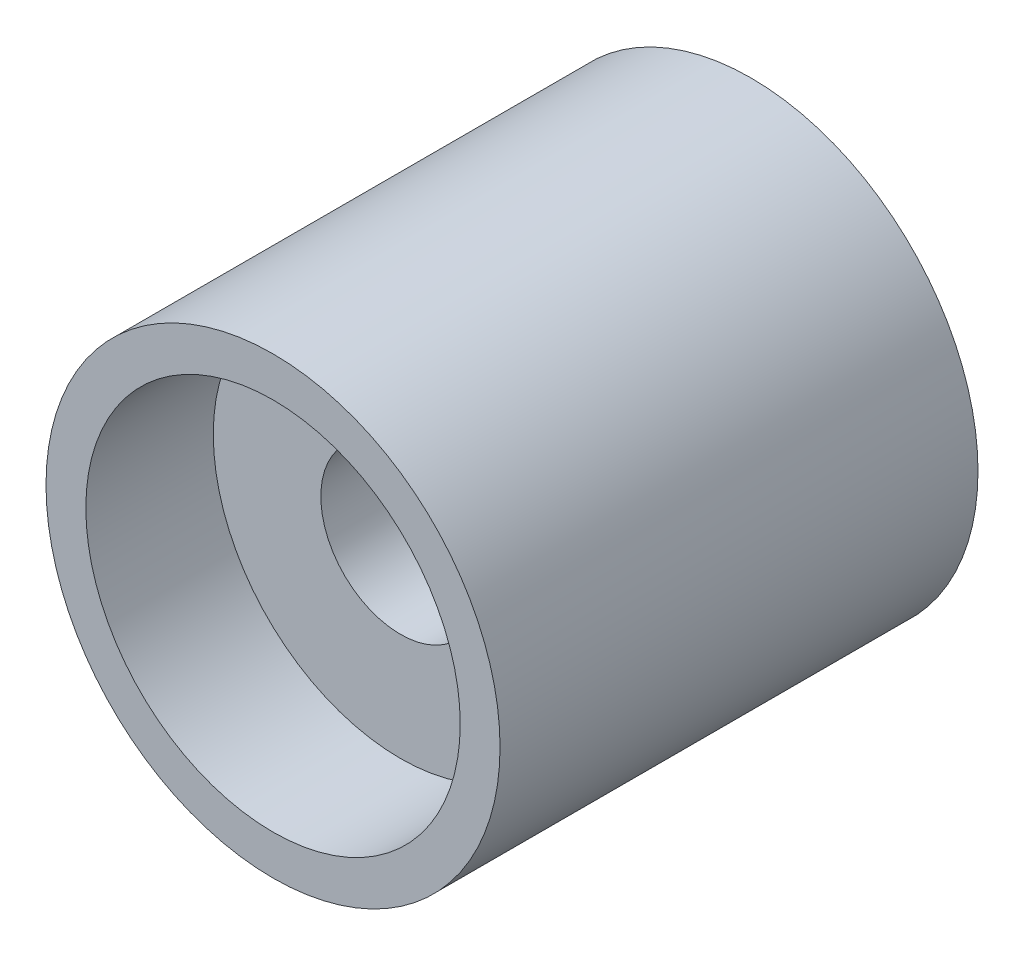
ISO-10303-21;
HEADER;
FILE_DESCRIPTION(('STEP AP214'),'2;1');
FILE_NAME('part.step','',(''),(''),'','','');
FILE_SCHEMA(('AUTOMOTIVE_DESIGN { 1 0 10303 214 1 1 1 1 }'));
ENDSEC;
DATA;
#1=APPLICATION_CONTEXT('core data for automotive mechanical design processes');
#2=APPLICATION_PROTOCOL_DEFINITION('international standard','automotive_design',2000,#1);
#3=PRODUCT_CONTEXT('',#1,'mechanical');
#4=PRODUCT('Part','Part','',(#3));
#5=PRODUCT_RELATED_PRODUCT_CATEGORY('part','',(#4));
#6=PRODUCT_DEFINITION_FORMATION('','',#4);
#7=PRODUCT_DEFINITION_CONTEXT('part definition',#1,'design');
#8=PRODUCT_DEFINITION('design','',#6,#7);
#9=PRODUCT_DEFINITION_SHAPE('','',#8);
#10=(LENGTH_UNIT() NAMED_UNIT(*) SI_UNIT(.MILLI.,.METRE.));
#11=(NAMED_UNIT(*) PLANE_ANGLE_UNIT() SI_UNIT($,.RADIAN.));
#12=(NAMED_UNIT(*) SI_UNIT($,.STERADIAN.) SOLID_ANGLE_UNIT());
#13=UNCERTAINTY_MEASURE_WITH_UNIT(LENGTH_MEASURE(1.E-05),#10,'distance_accuracy_value','');
#14=(GEOMETRIC_REPRESENTATION_CONTEXT(3) GLOBAL_UNCERTAINTY_ASSIGNED_CONTEXT((#13)) GLOBAL_UNIT_ASSIGNED_CONTEXT((#10,
#11,#12)) REPRESENTATION_CONTEXT('',''));
#15=CARTESIAN_POINT('',(0.,0.,0.));
#16=DIRECTION('',(0.,0.,1.));
#17=DIRECTION('',(1.,0.,0.));
#18=AXIS2_PLACEMENT_3D('',#15,#16,#17);
#19=CARTESIAN_POINT('',(0.,-34.5,-30.));
#20=DIRECTION('',(0.,0.,-1.));
#21=DIRECTION('',(1.,0.,0.));
#22=AXIS2_PLACEMENT_3D('',#19,#20,#21);
#23=PLANE('',#22);
#24=CARTESIAN_POINT('',(0.,0.,-30.));
#25=DIRECTION('',(0.,0.,-1.));
#26=DIRECTION('',(-1.,0.,0.));
#27=AXIS2_PLACEMENT_3D('',#24,#25,#26);
#28=CIRCLE('',#27,20.);
#29=CARTESIAN_POINT('',(-20.,0.,-30.));
#30=VERTEX_POINT('',#29);
#31=EDGE_CURVE('E35',#30,#30,#28,.T.);
#32=ORIENTED_EDGE('',*,*,#31,.F.);
#33=EDGE_LOOP('',(#32));
#34=FACE_BOUND('',#33,.T.);
#35=CARTESIAN_POINT('',(0.,0.,-30.));
#36=DIRECTION('',(0.,0.,1.));
#37=DIRECTION('',(1.,0.,0.));
#38=AXIS2_PLACEMENT_3D('',#35,#36,#37);
#39=CIRCLE('',#38,28.5);
#40=CARTESIAN_POINT('',(28.5,0.,-30.));
#41=VERTEX_POINT('',#40);
#42=EDGE_CURVE('E38',#41,#41,#39,.T.);
#43=ORIENTED_EDGE('',*,*,#42,.F.);
#44=EDGE_LOOP('',(#43));
#45=FACE_BOUND('',#44,.T.);
#46=ADVANCED_FACE('F12',(#34,#45),#23,.T.);
#47=CARTESIAN_POINT('',(0.,-34.5,30.));
#48=DIRECTION('',(0.,0.,1.));
#49=DIRECTION('',(-1.,0.,0.));
#50=AXIS2_PLACEMENT_3D('',#47,#48,#49);
#51=PLANE('',#50);
#52=CARTESIAN_POINT('',(0.,0.,30.));
#53=DIRECTION('',(0.,0.,-1.));
#54=DIRECTION('',(-1.,0.,0.));
#55=AXIS2_PLACEMENT_3D('',#52,#53,#54);
#56=CIRCLE('',#55,23.5);
#57=CARTESIAN_POINT('',(-23.5,0.,30.));
#58=VERTEX_POINT('',#57);
#59=EDGE_CURVE('E32',#58,#58,#56,.T.);
#60=ORIENTED_EDGE('',*,*,#59,.T.);
#61=EDGE_LOOP('',(#60));
#62=FACE_BOUND('',#61,.T.);
#63=CARTESIAN_POINT('',(0.,0.,30.));
#64=DIRECTION('',(0.,0.,1.));
#65=DIRECTION('',(1.,0.,0.));
#66=AXIS2_PLACEMENT_3D('',#63,#64,#65);
#67=CIRCLE('',#66,28.5);
#68=CARTESIAN_POINT('',(28.5,0.,30.));
#69=VERTEX_POINT('',#68);
#70=EDGE_CURVE('E39',#69,#69,#67,.T.);
#71=ORIENTED_EDGE('',*,*,#70,.T.);
#72=EDGE_LOOP('',(#71));
#73=FACE_BOUND('',#72,.T.);
#74=ADVANCED_FACE('F49',(#62,#73),#51,.T.);
#75=CARTESIAN_POINT('',(0.,-21.698214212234,14.));
#76=DIRECTION('',(0.,0.,1.));
#77=DIRECTION('',(-1.,0.,0.));
#78=AXIS2_PLACEMENT_3D('',#75,#76,#77);
#79=PLANE('',#78);
#80=CARTESIAN_POINT('',(0.,0.,14.));
#81=DIRECTION('',(0.,0.,-1.));
#82=DIRECTION('',(1.,0.,0.));
#83=AXIS2_PLACEMENT_3D('',#80,#81,#82);
#84=CIRCLE('',#83,10.);
#85=CARTESIAN_POINT('',(10.,0.,14.));
#86=VERTEX_POINT('',#85);
#87=EDGE_CURVE('E8',#86,#86,#84,.T.);
#88=ORIENTED_EDGE('',*,*,#87,.T.);
#89=EDGE_LOOP('',(#88));
#90=FACE_BOUND('',#89,.T.);
#91=CARTESIAN_POINT('',(0.,0.,14.));
#92=DIRECTION('',(0.,0.,-1.));
#93=DIRECTION('',(-1.,0.,0.));
#94=AXIS2_PLACEMENT_3D('',#91,#92,#93);
#95=CIRCLE('',#94,23.5);
#96=CARTESIAN_POINT('',(-23.5,0.,14.));
#97=VERTEX_POINT('',#96);
#98=EDGE_CURVE('E27',#97,#97,#95,.T.);
#99=ORIENTED_EDGE('',*,*,#98,.F.);
#100=EDGE_LOOP('',(#99));
#101=FACE_BOUND('',#100,.T.);
#102=ADVANCED_FACE('F14',(#90,#101),#79,.T.);
#103=CARTESIAN_POINT('',(0.,0.,-35.7089503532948));
#104=DIRECTION('',(0.,0.,-1.));
#105=DIRECTION('',(1.,0.,0.));
#106=AXIS2_PLACEMENT_3D('',#103,#104,#105);
#107=CYLINDRICAL_SURFACE('',#106,10.);
#108=CARTESIAN_POINT('',(0.,0.,-14.));
#109=DIRECTION('',(0.,0.,-1.));
#110=DIRECTION('',(1.,0.,0.));
#111=AXIS2_PLACEMENT_3D('',#108,#109,#110);
#112=CIRCLE('',#111,10.);
#113=CARTESIAN_POINT('',(10.,0.,-14.));
#114=VERTEX_POINT('',#113);
#115=EDGE_CURVE('E19',#114,#114,#112,.T.);
#116=ORIENTED_EDGE('',*,*,#115,.T.);
#117=EDGE_LOOP('',(#116));
#118=FACE_BOUND('',#117,.T.);
#119=ORIENTED_EDGE('',*,*,#87,.F.);
#120=EDGE_LOOP('',(#119));
#121=FACE_BOUND('',#120,.T.);
#122=ADVANCED_FACE('F69',(#118,#121),#107,.F.);
#123=CARTESIAN_POINT('',(0.,-20.,-14.));
#124=DIRECTION('',(0.,0.,-1.));
#125=DIRECTION('',(1.,0.,0.));
#126=AXIS2_PLACEMENT_3D('',#123,#124,#125);
#127=PLANE('',#126);
#128=CARTESIAN_POINT('',(0.,0.,-14.));
#129=DIRECTION('',(0.,0.,-1.));
#130=DIRECTION('',(1.,0.,0.));
#131=AXIS2_PLACEMENT_3D('',#128,#129,#130);
#132=CIRCLE('',#131,20.);
#133=CARTESIAN_POINT('',(20.,0.,-14.));
#134=VERTEX_POINT('',#133);
#135=EDGE_CURVE('E23',#134,#134,#132,.T.);
#136=ORIENTED_EDGE('',*,*,#135,.T.);
#137=EDGE_LOOP('',(#136));
#138=FACE_BOUND('',#137,.T.);
#139=ORIENTED_EDGE('',*,*,#115,.F.);
#140=EDGE_LOOP('',(#139));
#141=FACE_BOUND('',#140,.T.);
#142=ADVANCED_FACE('F66',(#138,#141),#127,.T.);
#143=CARTESIAN_POINT('',(0.,0.,-35.7089503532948));
#144=DIRECTION('',(0.,0.,-1.));
#145=DIRECTION('',(1.,0.,0.));
#146=AXIS2_PLACEMENT_3D('',#143,#144,#145);
#147=CYLINDRICAL_SURFACE('',#146,20.);
#148=ORIENTED_EDGE('',*,*,#135,.F.);
#149=EDGE_LOOP('',(#148));
#150=FACE_BOUND('',#149,.T.);
#151=ORIENTED_EDGE('',*,*,#31,.T.);
#152=EDGE_LOOP('',(#151));
#153=FACE_BOUND('',#152,.T.);
#154=ADVANCED_FACE('F62',(#150,#153),#147,.F.);
#155=CARTESIAN_POINT('',(0.,0.,-35.7089503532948));
#156=DIRECTION('',(0.,0.,-1.));
#157=DIRECTION('',(1.,0.,0.));
#158=AXIS2_PLACEMENT_3D('',#155,#156,#157);
#159=CYLINDRICAL_SURFACE('',#158,23.5);
#160=ORIENTED_EDGE('',*,*,#98,.T.);
#161=EDGE_LOOP('',(#160));
#162=FACE_BOUND('',#161,.T.);
#163=ORIENTED_EDGE('',*,*,#59,.F.);
#164=EDGE_LOOP('',(#163));
#165=FACE_BOUND('',#164,.T.);
#166=ADVANCED_FACE('F65',(#162,#165),#159,.F.);
#167=CARTESIAN_POINT('',(0.,0.,-30.));
#168=DIRECTION('',(0.,0.,1.));
#169=DIRECTION('',(1.,0.,0.));
#170=AXIS2_PLACEMENT_3D('',#167,#168,#169);
#171=CYLINDRICAL_SURFACE('',#170,28.5);
#172=ORIENTED_EDGE('',*,*,#42,.T.);
#173=EDGE_LOOP('',(#172));
#174=FACE_BOUND('',#173,.T.);
#175=ORIENTED_EDGE('',*,*,#70,.F.);
#176=EDGE_LOOP('',(#175));
#177=FACE_BOUND('',#176,.T.);
#178=ADVANCED_FACE('F45',(#174,#177),#171,.T.);
#179=CLOSED_SHELL('',(#46,#74,#102,#122,#142,#154,#166,#178));
#180=MANIFOLD_SOLID_BREP('B1',#179);
#181=ADVANCED_BREP_SHAPE_REPRESENTATION('',(#18,#180),#14);
#182=SHAPE_DEFINITION_REPRESENTATION(#9,#181);
ENDSEC;
END-ISO-10303-21;
